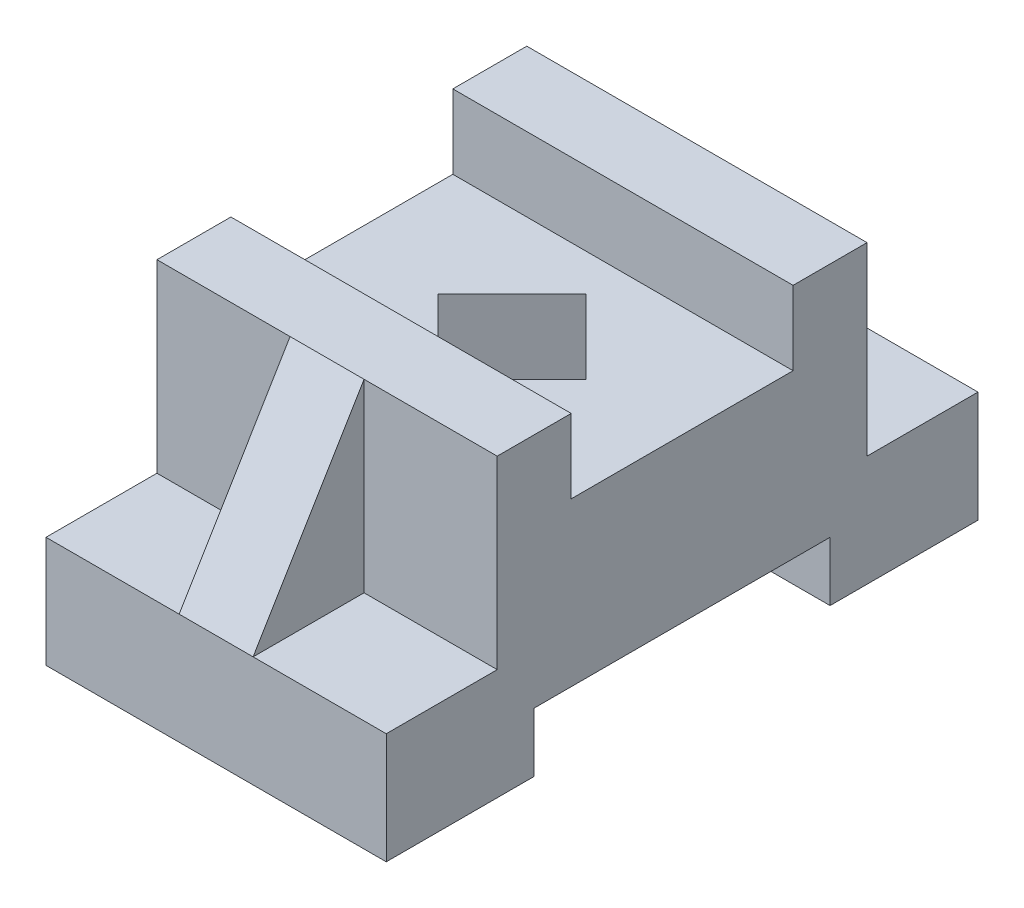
ISO-10303-21;
HEADER;
FILE_DESCRIPTION(('STEP AP214'),'2;1');
FILE_NAME('part.step','',(''),(''),'','','');
FILE_SCHEMA(('AUTOMOTIVE_DESIGN { 1 0 10303 214 1 1 1 1 }'));
ENDSEC;
DATA;
#1=APPLICATION_CONTEXT('core data for automotive mechanical design processes');
#2=APPLICATION_PROTOCOL_DEFINITION('international standard','automotive_design',2000,#1);
#3=PRODUCT_CONTEXT('',#1,'mechanical');
#4=PRODUCT('Part','Part','',(#3));
#5=PRODUCT_RELATED_PRODUCT_CATEGORY('part','',(#4));
#6=PRODUCT_DEFINITION_FORMATION('','',#4);
#7=PRODUCT_DEFINITION_CONTEXT('part definition',#1,'design');
#8=PRODUCT_DEFINITION('design','',#6,#7);
#9=PRODUCT_DEFINITION_SHAPE('','',#8);
#10=(LENGTH_UNIT() NAMED_UNIT(*) SI_UNIT(.MILLI.,.METRE.));
#11=(NAMED_UNIT(*) PLANE_ANGLE_UNIT() SI_UNIT($,.RADIAN.));
#12=(NAMED_UNIT(*) SI_UNIT($,.STERADIAN.) SOLID_ANGLE_UNIT());
#13=UNCERTAINTY_MEASURE_WITH_UNIT(LENGTH_MEASURE(1.E-05),#10,'distance_accuracy_value','');
#14=(GEOMETRIC_REPRESENTATION_CONTEXT(3) GLOBAL_UNCERTAINTY_ASSIGNED_CONTEXT((#13)) GLOBAL_UNIT_ASSIGNED_CONTEXT((#10,
#11,#12)) REPRESENTATION_CONTEXT('',''));
#15=CARTESIAN_POINT('',(0.,0.,0.));
#16=DIRECTION('',(0.,0.,1.));
#17=DIRECTION('',(1.,0.,0.));
#18=AXIS2_PLACEMENT_3D('',#15,#16,#17);
#19=CARTESIAN_POINT('',(23.,10.,0.));
#20=DIRECTION('',(1.,0.,0.));
#21=DIRECTION('',(0.,0.,-1.));
#22=AXIS2_PLACEMENT_3D('',#19,#20,#21);
#23=PLANE('',#22);
#24=DIRECTION('',(0.,0.,1.));
#25=VECTOR('',#24,1.);
#26=CARTESIAN_POINT('',(23.,-22.,0.));
#27=LINE('',#26,#25);
#28=CARTESIAN_POINT('',(23.,-22.,-20.));
#29=VERTEX_POINT('',#28);
#30=CARTESIAN_POINT('',(23.,-22.,20.));
#31=VERTEX_POINT('',#30);
#32=EDGE_CURVE('E226',#29,#31,#27,.T.);
#33=ORIENTED_EDGE('',*,*,#32,.F.);
#34=DIRECTION('',(0.,-1.,0.));
#35=VECTOR('',#34,1.);
#36=CARTESIAN_POINT('',(23.,-22.,-20.));
#37=LINE('',#36,#35);
#38=CARTESIAN_POINT('',(23.,-30.,-20.));
#39=VERTEX_POINT('',#38);
#40=EDGE_CURVE('E209',#29,#39,#37,.T.);
#41=ORIENTED_EDGE('',*,*,#40,.T.);
#42=DIRECTION('',(0.,0.,1.));
#43=VECTOR('',#42,1.);
#44=CARTESIAN_POINT('',(23.,-30.,0.));
#45=LINE('',#44,#43);
#46=CARTESIAN_POINT('',(23.,-30.,-40.));
#47=VERTEX_POINT('',#46);
#48=EDGE_CURVE('E379',#47,#39,#45,.T.);
#49=ORIENTED_EDGE('',*,*,#48,.F.);
#50=DIRECTION('',(0.,-1.,0.));
#51=VECTOR('',#50,1.);
#52=CARTESIAN_POINT('',(23.,10.,-40.));
#53=LINE('',#52,#51);
#54=CARTESIAN_POINT('',(23.,-15.,-40.));
#55=VERTEX_POINT('',#54);
#56=EDGE_CURVE('E39',#55,#47,#53,.T.);
#57=ORIENTED_EDGE('',*,*,#56,.F.);
#58=DIRECTION('',(0.,0.,-1.));
#59=VECTOR('',#58,1.);
#60=CARTESIAN_POINT('',(23.,-15.,0.));
#61=LINE('',#60,#59);
#62=CARTESIAN_POINT('',(23.,-15.,-25.));
#63=VERTEX_POINT('',#62);
#64=EDGE_CURVE('E293',#63,#55,#61,.T.);
#65=ORIENTED_EDGE('',*,*,#64,.F.);
#66=DIRECTION('',(0.,-1.,0.));
#67=VECTOR('',#66,1.);
#68=CARTESIAN_POINT('',(23.,10.,-25.));
#69=LINE('',#68,#67);
#70=CARTESIAN_POINT('',(23.,10.,-25.));
#71=VERTEX_POINT('',#70);
#72=EDGE_CURVE('E338',#71,#63,#69,.T.);
#73=ORIENTED_EDGE('',*,*,#72,.F.);
#74=DIRECTION('',(0.,0.,1.));
#75=VECTOR('',#74,1.);
#76=CARTESIAN_POINT('',(23.,10.,0.));
#77=LINE('',#76,#75);
#78=CARTESIAN_POINT('',(23.,10.,-15.));
#79=VERTEX_POINT('',#78);
#80=EDGE_CURVE('E394',#71,#79,#77,.T.);
#81=ORIENTED_EDGE('',*,*,#80,.T.);
#82=DIRECTION('',(0.,-1.,0.));
#83=VECTOR('',#82,1.);
#84=CARTESIAN_POINT('',(23.,10.,-15.));
#85=LINE('',#84,#83);
#86=CARTESIAN_POINT('',(23.,0.,-15.));
#87=VERTEX_POINT('',#86);
#88=EDGE_CURVE('E373',#79,#87,#85,.T.);
#89=ORIENTED_EDGE('',*,*,#88,.T.);
#90=DIRECTION('',(0.,0.,-1.));
#91=VECTOR('',#90,1.);
#92=CARTESIAN_POINT('',(23.,0.,0.));
#93=LINE('',#92,#91);
#94=CARTESIAN_POINT('',(23.,0.,15.0000000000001));
#95=VERTEX_POINT('',#94);
#96=EDGE_CURVE('E362',#95,#87,#93,.T.);
#97=ORIENTED_EDGE('',*,*,#96,.F.);
#98=DIRECTION('',(0.,-1.,0.));
#99=VECTOR('',#98,1.);
#100=CARTESIAN_POINT('',(23.,10.,15.0000000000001));
#101=LINE('',#100,#99);
#102=CARTESIAN_POINT('',(23.,10.,15.0000000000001));
#103=VERTEX_POINT('',#102);
#104=EDGE_CURVE('E376',#103,#95,#101,.T.);
#105=ORIENTED_EDGE('',*,*,#104,.F.);
#106=CARTESIAN_POINT('',(23.,10.,25.0000000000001));
#107=VERTEX_POINT('',#106);
#108=EDGE_CURVE('E391',#103,#107,#77,.T.);
#109=ORIENTED_EDGE('',*,*,#108,.T.);
#110=DIRECTION('',(0.,-1.,0.));
#111=VECTOR('',#110,1.);
#112=CARTESIAN_POINT('',(23.,10.,25.0000000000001));
#113=LINE('',#112,#111);
#114=CARTESIAN_POINT('',(23.,-15.,25.0000000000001));
#115=VERTEX_POINT('',#114);
#116=EDGE_CURVE('E319',#107,#115,#113,.T.);
#117=ORIENTED_EDGE('',*,*,#116,.T.);
#118=DIRECTION('',(0.,0.,1.));
#119=VECTOR('',#118,1.);
#120=CARTESIAN_POINT('',(23.,-15.,0.));
#121=LINE('',#120,#119);
#122=CARTESIAN_POINT('',(23.,-15.,40.0000000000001));
#123=VERTEX_POINT('',#122);
#124=EDGE_CURVE('E279',#115,#123,#121,.T.);
#125=ORIENTED_EDGE('',*,*,#124,.T.);
#126=DIRECTION('',(0.,-1.,0.));
#127=VECTOR('',#126,1.);
#128=CARTESIAN_POINT('',(23.,10.,40.0000000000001));
#129=LINE('',#128,#127);
#130=CARTESIAN_POINT('',(23.,-30.,40.0000000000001));
#131=VERTEX_POINT('',#130);
#132=EDGE_CURVE('E407',#123,#131,#129,.T.);
#133=ORIENTED_EDGE('',*,*,#132,.T.);
#134=CARTESIAN_POINT('',(23.,-30.,20.));
#135=VERTEX_POINT('',#134);
#136=EDGE_CURVE('E378',#135,#131,#45,.T.);
#137=ORIENTED_EDGE('',*,*,#136,.F.);
#138=DIRECTION('',(0.,-1.,0.));
#139=VECTOR('',#138,1.);
#140=CARTESIAN_POINT('',(23.,-22.,20.));
#141=LINE('',#140,#139);
#142=EDGE_CURVE('E60',#31,#135,#141,.T.);
#143=ORIENTED_EDGE('',*,*,#142,.F.);
#144=EDGE_LOOP('',(#33,#41,#49,#57,#65,#73,#81,#89,#97,#105,#109,#117,#125,#133,#137,#143));
#145=FACE_BOUND('',#144,.T.);
#146=ADVANCED_FACE('F36',(#145),#23,.T.);
#147=CARTESIAN_POINT('',(-23.,10.,0.));
#148=DIRECTION('',(1.,0.,0.));
#149=DIRECTION('',(0.,0.,-1.));
#150=AXIS2_PLACEMENT_3D('',#147,#148,#149);
#151=PLANE('',#150);
#152=DIRECTION('',(0.,-1.,0.));
#153=VECTOR('',#152,1.);
#154=CARTESIAN_POINT('',(-23.,-22.,-20.));
#155=LINE('',#154,#153);
#156=CARTESIAN_POINT('',(-23.,-22.,-20.));
#157=VERTEX_POINT('',#156);
#158=CARTESIAN_POINT('',(-23.,-30.,-20.));
#159=VERTEX_POINT('',#158);
#160=EDGE_CURVE('E246',#157,#159,#155,.T.);
#161=ORIENTED_EDGE('',*,*,#160,.F.);
#162=DIRECTION('',(0.,0.,-1.));
#163=VECTOR('',#162,1.);
#164=CARTESIAN_POINT('',(-23.,-22.,0.));
#165=LINE('',#164,#163);
#166=CARTESIAN_POINT('',(-23.,-22.,20.));
#167=VERTEX_POINT('',#166);
#168=EDGE_CURVE('E228',#167,#157,#165,.T.);
#169=ORIENTED_EDGE('',*,*,#168,.F.);
#170=DIRECTION('',(0.,-1.,0.));
#171=VECTOR('',#170,1.);
#172=CARTESIAN_POINT('',(-23.,-22.,20.));
#173=LINE('',#172,#171);
#174=CARTESIAN_POINT('',(-23.,-30.,20.));
#175=VERTEX_POINT('',#174);
#176=EDGE_CURVE('E249',#167,#175,#173,.T.);
#177=ORIENTED_EDGE('',*,*,#176,.T.);
#178=DIRECTION('',(0.,0.,1.));
#179=VECTOR('',#178,1.);
#180=CARTESIAN_POINT('',(-23.,-30.,0.));
#181=LINE('',#180,#179);
#182=CARTESIAN_POINT('',(-23.,-30.,40.0000000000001));
#183=VERTEX_POINT('',#182);
#184=EDGE_CURVE('E384',#175,#183,#181,.T.);
#185=ORIENTED_EDGE('',*,*,#184,.T.);
#186=DIRECTION('',(0.,-1.,0.));
#187=VECTOR('',#186,1.);
#188=CARTESIAN_POINT('',(-23.,10.,40.0000000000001));
#189=LINE('',#188,#187);
#190=CARTESIAN_POINT('',(-23.,-15.,40.0000000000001));
#191=VERTEX_POINT('',#190);
#192=EDGE_CURVE('E410',#191,#183,#189,.T.);
#193=ORIENTED_EDGE('',*,*,#192,.F.);
#194=DIRECTION('',(0.,0.,1.));
#195=VECTOR('',#194,1.);
#196=CARTESIAN_POINT('',(-23.,-15.,0.));
#197=LINE('',#196,#195);
#198=CARTESIAN_POINT('',(-23.,-15.,25.0000000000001));
#199=VERTEX_POINT('',#198);
#200=EDGE_CURVE('E313',#199,#191,#197,.T.);
#201=ORIENTED_EDGE('',*,*,#200,.F.);
#202=DIRECTION('',(0.,-1.,0.));
#203=VECTOR('',#202,1.);
#204=CARTESIAN_POINT('',(-23.,10.,25.0000000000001));
#205=LINE('',#204,#203);
#206=CARTESIAN_POINT('',(-23.,10.,25.0000000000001));
#207=VERTEX_POINT('',#206);
#208=EDGE_CURVE('E318',#207,#199,#205,.T.);
#209=ORIENTED_EDGE('',*,*,#208,.F.);
#210=DIRECTION('',(0.,0.,1.));
#211=VECTOR('',#210,1.);
#212=CARTESIAN_POINT('',(-23.,10.,0.));
#213=LINE('',#212,#211);
#214=CARTESIAN_POINT('',(-23.,10.,15.0000000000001));
#215=VERTEX_POINT('',#214);
#216=EDGE_CURVE('E395',#215,#207,#213,.T.);
#217=ORIENTED_EDGE('',*,*,#216,.F.);
#218=DIRECTION('',(0.,-1.,0.));
#219=VECTOR('',#218,1.);
#220=CARTESIAN_POINT('',(-23.,10.,15.0000000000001));
#221=LINE('',#220,#219);
#222=CARTESIAN_POINT('',(-23.,0.,15.0000000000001));
#223=VERTEX_POINT('',#222);
#224=EDGE_CURVE('E347',#215,#223,#221,.T.);
#225=ORIENTED_EDGE('',*,*,#224,.T.);
#226=DIRECTION('',(0.,0.,-1.));
#227=VECTOR('',#226,1.);
#228=CARTESIAN_POINT('',(-23.,0.,0.));
#229=LINE('',#228,#227);
#230=CARTESIAN_POINT('',(-23.,0.,-15.));
#231=VERTEX_POINT('',#230);
#232=EDGE_CURVE('E344',#223,#231,#229,.T.);
#233=ORIENTED_EDGE('',*,*,#232,.T.);
#234=DIRECTION('',(0.,-1.,0.));
#235=VECTOR('',#234,1.);
#236=CARTESIAN_POINT('',(-23.,10.,-15.));
#237=LINE('',#236,#235);
#238=CARTESIAN_POINT('',(-23.,10.,-15.));
#239=VERTEX_POINT('',#238);
#240=EDGE_CURVE('E371',#239,#231,#237,.T.);
#241=ORIENTED_EDGE('',*,*,#240,.F.);
#242=CARTESIAN_POINT('',(-23.,10.,-25.));
#243=VERTEX_POINT('',#242);
#244=EDGE_CURVE('E398',#243,#239,#213,.T.);
#245=ORIENTED_EDGE('',*,*,#244,.F.);
#246=DIRECTION('',(0.,-1.,0.));
#247=VECTOR('',#246,1.);
#248=CARTESIAN_POINT('',(-23.,10.,-25.));
#249=LINE('',#248,#247);
#250=CARTESIAN_POINT('',(-23.,-15.,-25.));
#251=VERTEX_POINT('',#250);
#252=EDGE_CURVE('E328',#243,#251,#249,.T.);
#253=ORIENTED_EDGE('',*,*,#252,.T.);
#254=DIRECTION('',(0.,0.,-1.));
#255=VECTOR('',#254,1.);
#256=CARTESIAN_POINT('',(-23.,-15.,0.));
#257=LINE('',#256,#255);
#258=CARTESIAN_POINT('',(-23.,-15.,-40.));
#259=VERTEX_POINT('',#258);
#260=EDGE_CURVE('E298',#251,#259,#257,.T.);
#261=ORIENTED_EDGE('',*,*,#260,.T.);
#262=DIRECTION('',(0.,-1.,0.));
#263=VECTOR('',#262,1.);
#264=CARTESIAN_POINT('',(-23.,10.,-40.));
#265=LINE('',#264,#263);
#266=CARTESIAN_POINT('',(-23.,-30.,-40.));
#267=VERTEX_POINT('',#266);
#268=EDGE_CURVE('E412',#259,#267,#265,.T.);
#269=ORIENTED_EDGE('',*,*,#268,.T.);
#270=EDGE_CURVE('E385',#267,#159,#181,.T.);
#271=ORIENTED_EDGE('',*,*,#270,.T.);
#272=EDGE_LOOP('',(#161,#169,#177,#185,#193,#201,#209,#217,#225,#233,#241,#245,#253,#261,#269,#271));
#273=FACE_BOUND('',#272,.T.);
#274=ADVANCED_FACE('F424',(#273),#151,.F.);
#275=CARTESIAN_POINT('',(4.99999999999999,10.,-4.99999999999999));
#276=DIRECTION('',(-0.707106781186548,0.,0.707106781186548));
#277=DIRECTION('',(0.707106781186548,0.,0.707106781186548));
#278=AXIS2_PLACEMENT_3D('',#275,#276,#277);
#279=PLANE('',#278);
#280=DIRECTION('',(0.,-1.,0.));
#281=VECTOR('',#280,1.);
#282=CARTESIAN_POINT('',(0.,10.,-9.99999999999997));
#283=LINE('',#282,#281);
#284=CARTESIAN_POINT('',(0.,0.,-9.99999999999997));
#285=VERTEX_POINT('',#284);
#286=CARTESIAN_POINT('',(0.,-22.,-9.99999999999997));
#287=VERTEX_POINT('',#286);
#288=EDGE_CURVE('E399',#285,#287,#283,.T.);
#289=ORIENTED_EDGE('',*,*,#288,.T.);
#290=DIRECTION('',(-0.707106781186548,0.,-0.707106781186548));
#291=VECTOR('',#290,1.);
#292=CARTESIAN_POINT('',(4.99999999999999,-22.,-4.99999999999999));
#293=LINE('',#292,#291);
#294=CARTESIAN_POINT('',(10.,-22.,0.));
#295=VERTEX_POINT('',#294);
#296=EDGE_CURVE('E52',#295,#287,#293,.T.);
#297=ORIENTED_EDGE('',*,*,#296,.F.);
#298=DIRECTION('',(0.,-1.,0.));
#299=VECTOR('',#298,1.);
#300=CARTESIAN_POINT('',(10.,10.,0.));
#301=LINE('',#300,#299);
#302=CARTESIAN_POINT('',(10.,0.,0.));
#303=VERTEX_POINT('',#302);
#304=EDGE_CURVE('E11',#303,#295,#301,.T.);
#305=ORIENTED_EDGE('',*,*,#304,.F.);
#306=DIRECTION('',(-0.707106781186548,0.,-0.707106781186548));
#307=VECTOR('',#306,1.);
#308=CARTESIAN_POINT('',(4.99999999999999,0.,-4.99999999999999));
#309=LINE('',#308,#307);
#310=EDGE_CURVE('E323',#303,#285,#309,.T.);
#311=ORIENTED_EDGE('',*,*,#310,.T.);
#312=EDGE_LOOP('',(#289,#297,#305,#311));
#313=FACE_BOUND('',#312,.T.);
#314=ADVANCED_FACE('F474',(#313),#279,.T.);
#315=CARTESIAN_POINT('',(5.00000000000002,10.,5.00000000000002));
#316=DIRECTION('',(-0.707106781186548,0.,-0.707106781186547));
#317=DIRECTION('',(-0.707106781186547,0.,0.707106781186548));
#318=AXIS2_PLACEMENT_3D('',#315,#316,#317);
#319=PLANE('',#318);
#320=ORIENTED_EDGE('',*,*,#304,.T.);
#321=DIRECTION('',(0.707106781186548,0.,-0.707106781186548));
#322=VECTOR('',#321,1.);
#323=CARTESIAN_POINT('',(5.00000000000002,-22.,5.00000000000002));
#324=LINE('',#323,#322);
#325=CARTESIAN_POINT('',(0.,-22.,10.));
#326=VERTEX_POINT('',#325);
#327=EDGE_CURVE('E238',#326,#295,#324,.T.);
#328=ORIENTED_EDGE('',*,*,#327,.F.);
#329=DIRECTION('',(0.,-1.,0.));
#330=VECTOR('',#329,1.);
#331=CARTESIAN_POINT('',(0.,10.,10.));
#332=LINE('',#331,#330);
#333=CARTESIAN_POINT('',(0.,0.,10.));
#334=VERTEX_POINT('',#333);
#335=EDGE_CURVE('E44',#334,#326,#332,.T.);
#336=ORIENTED_EDGE('',*,*,#335,.F.);
#337=DIRECTION('',(0.707106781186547,0.,-0.707106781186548));
#338=VECTOR('',#337,1.);
#339=CARTESIAN_POINT('',(5.00000000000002,0.,5.00000000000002));
#340=LINE('',#339,#338);
#341=EDGE_CURVE('E350',#334,#303,#340,.T.);
#342=ORIENTED_EDGE('',*,*,#341,.T.);
#343=EDGE_LOOP('',(#320,#328,#336,#342));
#344=FACE_BOUND('',#343,.T.);
#345=ADVANCED_FACE('F479',(#344),#319,.T.);
#346=CARTESIAN_POINT('',(-5.00000000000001,10.,5.00000000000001));
#347=DIRECTION('',(0.707106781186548,0.,-0.707106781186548));
#348=DIRECTION('',(-0.707106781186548,0.,-0.707106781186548));
#349=AXIS2_PLACEMENT_3D('',#346,#347,#348);
#350=PLANE('',#349);
#351=ORIENTED_EDGE('',*,*,#335,.T.);
#352=DIRECTION('',(0.707106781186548,0.,0.707106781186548));
#353=VECTOR('',#352,1.);
#354=CARTESIAN_POINT('',(-5.00000000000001,-22.,5.00000000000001));
#355=LINE('',#354,#353);
#356=CARTESIAN_POINT('',(-9.99999999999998,-22.,0.));
#357=VERTEX_POINT('',#356);
#358=EDGE_CURVE('E220',#357,#326,#355,.T.);
#359=ORIENTED_EDGE('',*,*,#358,.F.);
#360=DIRECTION('',(0.,-1.,0.));
#361=VECTOR('',#360,1.);
#362=CARTESIAN_POINT('',(-9.99999999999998,10.,0.));
#363=LINE('',#362,#361);
#364=CARTESIAN_POINT('',(-9.99999999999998,0.,0.));
#365=VERTEX_POINT('',#364);
#366=EDGE_CURVE('E402',#365,#357,#363,.T.);
#367=ORIENTED_EDGE('',*,*,#366,.F.);
#368=DIRECTION('',(0.707106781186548,0.,0.707106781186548));
#369=VECTOR('',#368,1.);
#370=CARTESIAN_POINT('',(-5.00000000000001,0.,5.00000000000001));
#371=LINE('',#370,#369);
#372=EDGE_CURVE('E353',#365,#334,#371,.T.);
#373=ORIENTED_EDGE('',*,*,#372,.T.);
#374=EDGE_LOOP('',(#351,#359,#367,#373));
#375=FACE_BOUND('',#374,.T.);
#376=ADVANCED_FACE('F494',(#375),#350,.T.);
#377=CARTESIAN_POINT('',(-4.99999999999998,10.,-4.99999999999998));
#378=DIRECTION('',(0.707106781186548,0.,0.707106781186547));
#379=DIRECTION('',(0.707106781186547,0.,-0.707106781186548));
#380=AXIS2_PLACEMENT_3D('',#377,#378,#379);
#381=PLANE('',#380);
#382=ORIENTED_EDGE('',*,*,#366,.T.);
#383=DIRECTION('',(-0.707106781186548,0.,0.707106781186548));
#384=VECTOR('',#383,1.);
#385=CARTESIAN_POINT('',(-4.99999999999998,-22.,-4.99999999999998));
#386=LINE('',#385,#384);
#387=EDGE_CURVE('E241',#287,#357,#386,.T.);
#388=ORIENTED_EDGE('',*,*,#387,.F.);
#389=ORIENTED_EDGE('',*,*,#288,.F.);
#390=DIRECTION('',(-0.707106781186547,0.,0.707106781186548));
#391=VECTOR('',#390,1.);
#392=CARTESIAN_POINT('',(-4.99999999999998,0.,-4.99999999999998));
#393=LINE('',#392,#391);
#394=EDGE_CURVE('E356',#285,#365,#393,.T.);
#395=ORIENTED_EDGE('',*,*,#394,.T.);
#396=EDGE_LOOP('',(#382,#388,#389,#395));
#397=FACE_BOUND('',#396,.T.);
#398=ADVANCED_FACE('F489',(#397),#381,.T.);
#399=CARTESIAN_POINT('',(0.,-30.,0.));
#400=DIRECTION('',(0.,1.,0.));
#401=DIRECTION('',(0.,0.,1.));
#402=AXIS2_PLACEMENT_3D('',#399,#400,#401);
#403=PLANE('',#402);
#404=DIRECTION('',(-1.,0.,0.));
#405=VECTOR('',#404,1.);
#406=CARTESIAN_POINT('',(0.,-30.,-20.));
#407=LINE('',#406,#405);
#408=EDGE_CURVE('E215',#39,#159,#407,.T.);
#409=ORIENTED_EDGE('',*,*,#408,.T.);
#410=ORIENTED_EDGE('',*,*,#270,.F.);
#411=DIRECTION('',(1.,0.,0.));
#412=VECTOR('',#411,1.);
#413=CARTESIAN_POINT('',(0.,-30.,-40.));
#414=LINE('',#413,#412);
#415=EDGE_CURVE('E381',#267,#47,#414,.T.);
#416=ORIENTED_EDGE('',*,*,#415,.T.);
#417=ORIENTED_EDGE('',*,*,#48,.T.);
#418=EDGE_LOOP('',(#409,#410,#416,#417));
#419=FACE_BOUND('',#418,.T.);
#420=ADVANCED_FACE('F423',(#419),#403,.F.);
#421=CARTESIAN_POINT('',(0.,10.,-40.));
#422=DIRECTION('',(0.,0.,-1.));
#423=DIRECTION('',(-1.,0.,0.));
#424=AXIS2_PLACEMENT_3D('',#421,#422,#423);
#425=PLANE('',#424);
#426=DIRECTION('',(1.,0.,0.));
#427=VECTOR('',#426,1.);
#428=CARTESIAN_POINT('',(-9.99999999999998,-15.,-40.));
#429=LINE('',#428,#427);
#430=CARTESIAN_POINT('',(-4.99999999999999,-15.,-40.));
#431=VERTEX_POINT('',#430);
#432=CARTESIAN_POINT('',(5.00000000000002,-15.,-40.));
#433=VERTEX_POINT('',#432);
#434=EDGE_CURVE('E255',#431,#433,#429,.T.);
#435=ORIENTED_EDGE('',*,*,#434,.T.);
#436=DIRECTION('',(1.,0.,0.));
#437=VECTOR('',#436,1.);
#438=CARTESIAN_POINT('',(0.,-15.,-40.));
#439=LINE('',#438,#437);
#440=EDGE_CURVE('E277',#433,#55,#439,.T.);
#441=ORIENTED_EDGE('',*,*,#440,.T.);
#442=ORIENTED_EDGE('',*,*,#56,.T.);
#443=ORIENTED_EDGE('',*,*,#415,.F.);
#444=ORIENTED_EDGE('',*,*,#268,.F.);
#445=DIRECTION('',(1.,0.,0.));
#446=VECTOR('',#445,1.);
#447=CARTESIAN_POINT('',(0.,-15.,-40.));
#448=LINE('',#447,#446);
#449=EDGE_CURVE('E272',#259,#431,#448,.T.);
#450=ORIENTED_EDGE('',*,*,#449,.T.);
#451=EDGE_LOOP('',(#435,#441,#442,#443,#444,#450));
#452=FACE_BOUND('',#451,.T.);
#453=ADVANCED_FACE('F418',(#452),#425,.T.);
#454=CARTESIAN_POINT('',(0.,10.,40.0000000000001));
#455=DIRECTION('',(0.,0.,-1.));
#456=DIRECTION('',(-1.,0.,0.));
#457=AXIS2_PLACEMENT_3D('',#454,#455,#456);
#458=PLANE('',#457);
#459=DIRECTION('',(1.,0.,0.));
#460=VECTOR('',#459,1.);
#461=CARTESIAN_POINT('',(0.,-15.,40.0000000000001));
#462=LINE('',#461,#460);
#463=CARTESIAN_POINT('',(5.00000000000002,-15.,40.0000000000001));
#464=VERTEX_POINT('',#463);
#465=EDGE_CURVE('E276',#464,#123,#462,.T.);
#466=ORIENTED_EDGE('',*,*,#465,.F.);
#467=DIRECTION('',(1.,0.,0.));
#468=VECTOR('',#467,1.);
#469=CARTESIAN_POINT('',(-9.99999999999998,-15.,40.0000000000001));
#470=LINE('',#469,#468);
#471=CARTESIAN_POINT('',(-4.99999999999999,-15.,40.0000000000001));
#472=VERTEX_POINT('',#471);
#473=EDGE_CURVE('E263',#472,#464,#470,.T.);
#474=ORIENTED_EDGE('',*,*,#473,.F.);
#475=DIRECTION('',(1.,0.,0.));
#476=VECTOR('',#475,1.);
#477=CARTESIAN_POINT('',(0.,-15.,40.0000000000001));
#478=LINE('',#477,#476);
#479=EDGE_CURVE('E285',#191,#472,#478,.T.);
#480=ORIENTED_EDGE('',*,*,#479,.F.);
#481=ORIENTED_EDGE('',*,*,#192,.T.);
#482=DIRECTION('',(1.,0.,0.));
#483=VECTOR('',#482,1.);
#484=CARTESIAN_POINT('',(0.,-30.,40.0000000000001));
#485=LINE('',#484,#483);
#486=EDGE_CURVE('E388',#183,#131,#485,.T.);
#487=ORIENTED_EDGE('',*,*,#486,.T.);
#488=ORIENTED_EDGE('',*,*,#132,.F.);
#489=EDGE_LOOP('',(#466,#474,#480,#481,#487,#488));
#490=FACE_BOUND('',#489,.T.);
#491=ADVANCED_FACE('F433',(#490),#458,.F.);
#492=CARTESIAN_POINT('',(0.,10.,0.));
#493=DIRECTION('',(0.,1.,0.));
#494=DIRECTION('',(0.,0.,1.));
#495=AXIS2_PLACEMENT_3D('',#492,#493,#494);
#496=PLANE('',#495);
#497=DIRECTION('',(1.,0.,0.));
#498=VECTOR('',#497,1.);
#499=CARTESIAN_POINT('',(-9.99999999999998,10.,-25.));
#500=LINE('',#499,#498);
#501=CARTESIAN_POINT('',(-4.99999999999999,10.,-25.));
#502=VERTEX_POINT('',#501);
#503=CARTESIAN_POINT('',(5.00000000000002,10.,-25.));
#504=VERTEX_POINT('',#503);
#505=EDGE_CURVE('E257',#502,#504,#500,.T.);
#506=ORIENTED_EDGE('',*,*,#505,.F.);
#507=DIRECTION('',(1.,0.,0.));
#508=VECTOR('',#507,1.);
#509=CARTESIAN_POINT('',(0.,10.,-25.));
#510=LINE('',#509,#508);
#511=EDGE_CURVE('E331',#243,#502,#510,.T.);
#512=ORIENTED_EDGE('',*,*,#511,.F.);
#513=ORIENTED_EDGE('',*,*,#244,.T.);
#514=DIRECTION('',(1.,0.,0.));
#515=VECTOR('',#514,1.);
#516=CARTESIAN_POINT('',(0.,10.,-15.));
#517=LINE('',#516,#515);
#518=EDGE_CURVE('E343',#239,#79,#517,.T.);
#519=ORIENTED_EDGE('',*,*,#518,.T.);
#520=ORIENTED_EDGE('',*,*,#80,.F.);
#521=DIRECTION('',(1.,0.,0.));
#522=VECTOR('',#521,1.);
#523=CARTESIAN_POINT('',(0.,10.,-25.));
#524=LINE('',#523,#522);
#525=EDGE_CURVE('E315',#504,#71,#524,.T.);
#526=ORIENTED_EDGE('',*,*,#525,.F.);
#527=EDGE_LOOP('',(#506,#512,#513,#519,#520,#526));
#528=FACE_BOUND('',#527,.T.);
#529=ADVANCED_FACE('F488',(#528),#496,.T.);
#530=DIRECTION('',(1.,0.,0.));
#531=VECTOR('',#530,1.);
#532=CARTESIAN_POINT('',(-9.99999999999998,10.,25.0000000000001));
#533=LINE('',#532,#531);
#534=CARTESIAN_POINT('',(-4.99999999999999,10.,25.0000000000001));
#535=VERTEX_POINT('',#534);
#536=CARTESIAN_POINT('',(5.00000000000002,10.,25.0000000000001));
#537=VERTEX_POINT('',#536);
#538=EDGE_CURVE('E256',#535,#537,#533,.T.);
#539=ORIENTED_EDGE('',*,*,#538,.T.);
#540=DIRECTION('',(1.,0.,0.));
#541=VECTOR('',#540,1.);
#542=CARTESIAN_POINT('',(0.,10.,25.0000000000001));
#543=LINE('',#542,#541);
#544=EDGE_CURVE('E324',#537,#107,#543,.T.);
#545=ORIENTED_EDGE('',*,*,#544,.T.);
#546=ORIENTED_EDGE('',*,*,#108,.F.);
#547=DIRECTION('',(1.,0.,0.));
#548=VECTOR('',#547,1.);
#549=CARTESIAN_POINT('',(0.,10.,15.0000000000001));
#550=LINE('',#549,#548);
#551=EDGE_CURVE('E341',#215,#103,#550,.T.);
#552=ORIENTED_EDGE('',*,*,#551,.F.);
#553=ORIENTED_EDGE('',*,*,#216,.T.);
#554=DIRECTION('',(1.,0.,0.));
#555=VECTOR('',#554,1.);
#556=CARTESIAN_POINT('',(0.,10.,25.0000000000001));
#557=LINE('',#556,#555);
#558=EDGE_CURVE('E316',#207,#535,#557,.T.);
#559=ORIENTED_EDGE('',*,*,#558,.T.);
#560=EDGE_LOOP('',(#539,#545,#546,#552,#553,#559));
#561=FACE_BOUND('',#560,.T.);
#562=ADVANCED_FACE('F448',(#561),#496,.T.);
#563=ORIENTED_EDGE('',*,*,#184,.F.);
#564=DIRECTION('',(-1.,0.,0.));
#565=VECTOR('',#564,1.);
#566=CARTESIAN_POINT('',(0.,-30.,20.));
#567=LINE('',#566,#565);
#568=EDGE_CURVE('E230',#135,#175,#567,.T.);
#569=ORIENTED_EDGE('',*,*,#568,.F.);
#570=ORIENTED_EDGE('',*,*,#136,.T.);
#571=ORIENTED_EDGE('',*,*,#486,.F.);
#572=EDGE_LOOP('',(#563,#569,#570,#571));
#573=FACE_BOUND('',#572,.T.);
#574=ADVANCED_FACE('F429',(#573),#403,.F.);
#575=CARTESIAN_POINT('',(0.,10.,15.0000000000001));
#576=DIRECTION('',(0.,0.,-1.));
#577=DIRECTION('',(-1.,0.,0.));
#578=AXIS2_PLACEMENT_3D('',#575,#576,#577);
#579=PLANE('',#578);
#580=DIRECTION('',(1.,0.,0.));
#581=VECTOR('',#580,1.);
#582=CARTESIAN_POINT('',(0.,0.,15.0000000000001));
#583=LINE('',#582,#581);
#584=EDGE_CURVE('E359',#223,#95,#583,.T.);
#585=ORIENTED_EDGE('',*,*,#584,.F.);
#586=ORIENTED_EDGE('',*,*,#224,.F.);
#587=ORIENTED_EDGE('',*,*,#551,.T.);
#588=ORIENTED_EDGE('',*,*,#104,.T.);
#589=EDGE_LOOP('',(#585,#586,#587,#588));
#590=FACE_BOUND('',#589,.T.);
#591=ADVANCED_FACE('F500',(#590),#579,.T.);
#592=CARTESIAN_POINT('',(0.,10.,-15.));
#593=DIRECTION('',(0.,0.,-1.));
#594=DIRECTION('',(-1.,0.,0.));
#595=AXIS2_PLACEMENT_3D('',#592,#593,#594);
#596=PLANE('',#595);
#597=DIRECTION('',(1.,0.,0.));
#598=VECTOR('',#597,1.);
#599=CARTESIAN_POINT('',(0.,0.,-15.));
#600=LINE('',#599,#598);
#601=EDGE_CURVE('E364',#231,#87,#600,.T.);
#602=ORIENTED_EDGE('',*,*,#601,.T.);
#603=ORIENTED_EDGE('',*,*,#88,.F.);
#604=ORIENTED_EDGE('',*,*,#518,.F.);
#605=ORIENTED_EDGE('',*,*,#240,.T.);
#606=EDGE_LOOP('',(#602,#603,#604,#605));
#607=FACE_BOUND('',#606,.T.);
#608=ADVANCED_FACE('F466',(#607),#596,.F.);
#609=CARTESIAN_POINT('',(0.,0.,0.));
#610=DIRECTION('',(0.,1.,0.));
#611=DIRECTION('',(0.,0.,1.));
#612=AXIS2_PLACEMENT_3D('',#609,#610,#611);
#613=PLANE('',#612);
#614=ORIENTED_EDGE('',*,*,#310,.F.);
#615=ORIENTED_EDGE('',*,*,#341,.F.);
#616=ORIENTED_EDGE('',*,*,#372,.F.);
#617=ORIENTED_EDGE('',*,*,#394,.F.);
#618=EDGE_LOOP('',(#614,#615,#616,#617));
#619=FACE_BOUND('',#618,.T.);
#620=ORIENTED_EDGE('',*,*,#584,.T.);
#621=ORIENTED_EDGE('',*,*,#96,.T.);
#622=ORIENTED_EDGE('',*,*,#601,.F.);
#623=ORIENTED_EDGE('',*,*,#232,.F.);
#624=EDGE_LOOP('',(#620,#621,#622,#623));
#625=FACE_BOUND('',#624,.T.);
#626=ADVANCED_FACE('F458',(#619,#625),#613,.T.);
#627=CARTESIAN_POINT('',(-4.99999999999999,10.,0.));
#628=DIRECTION('',(-1.,0.,0.));
#629=DIRECTION('',(0.,0.,1.));
#630=AXIS2_PLACEMENT_3D('',#627,#628,#629);
#631=PLANE('',#630);
#632=DIRECTION('',(0.,-0.857492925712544,0.514495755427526));
#633=VECTOR('',#632,1.);
#634=CARTESIAN_POINT('',(-4.99999999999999,21.0294117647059,18.3823529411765));
#635=LINE('',#634,#633);
#636=EDGE_CURVE('E259',#535,#472,#635,.T.);
#637=ORIENTED_EDGE('',*,*,#636,.F.);
#638=DIRECTION('',(0.,-1.,0.));
#639=VECTOR('',#638,1.);
#640=CARTESIAN_POINT('',(-4.99999999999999,10.,25.0000000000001));
#641=LINE('',#640,#639);
#642=CARTESIAN_POINT('',(-4.99999999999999,-15.,25.0000000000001));
#643=VERTEX_POINT('',#642);
#644=EDGE_CURVE('E321',#535,#643,#641,.T.);
#645=ORIENTED_EDGE('',*,*,#644,.T.);
#646=DIRECTION('',(0.,0.,-1.));
#647=VECTOR('',#646,1.);
#648=CARTESIAN_POINT('',(-4.99999999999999,-15.,0.));
#649=LINE('',#648,#647);
#650=EDGE_CURVE('E307',#472,#643,#649,.T.);
#651=ORIENTED_EDGE('',*,*,#650,.F.);
#652=EDGE_LOOP('',(#637,#645,#651));
#653=FACE_BOUND('',#652,.T.);
#654=ADVANCED_FACE('F456',(#653),#631,.T.);
#655=CARTESIAN_POINT('',(0.,10.,25.0000000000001));
#656=DIRECTION('',(0.,0.,-1.));
#657=DIRECTION('',(-1.,0.,0.));
#658=AXIS2_PLACEMENT_3D('',#655,#656,#657);
#659=PLANE('',#658);
#660=ORIENTED_EDGE('',*,*,#208,.T.);
#661=DIRECTION('',(1.,0.,0.));
#662=VECTOR('',#661,1.);
#663=CARTESIAN_POINT('',(0.,-15.,25.0000000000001));
#664=LINE('',#663,#662);
#665=EDGE_CURVE('E310',#199,#643,#664,.T.);
#666=ORIENTED_EDGE('',*,*,#665,.T.);
#667=ORIENTED_EDGE('',*,*,#644,.F.);
#668=ORIENTED_EDGE('',*,*,#558,.F.);
#669=EDGE_LOOP('',(#660,#666,#667,#668));
#670=FACE_BOUND('',#669,.T.);
#671=ADVANCED_FACE('F445',(#670),#659,.F.);
#672=CARTESIAN_POINT('',(5.00000000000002,10.,0.));
#673=DIRECTION('',(-1.,0.,0.));
#674=DIRECTION('',(0.,0.,1.));
#675=AXIS2_PLACEMENT_3D('',#672,#673,#674);
#676=PLANE('',#675);
#677=DIRECTION('',(0.,-1.,0.));
#678=VECTOR('',#677,1.);
#679=CARTESIAN_POINT('',(5.00000000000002,10.,25.0000000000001));
#680=LINE('',#679,#678);
#681=CARTESIAN_POINT('',(5.00000000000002,-15.,25.0000000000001));
#682=VERTEX_POINT('',#681);
#683=EDGE_CURVE('E327',#537,#682,#680,.T.);
#684=ORIENTED_EDGE('',*,*,#683,.F.);
#685=DIRECTION('',(0.,0.857492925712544,-0.514495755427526));
#686=VECTOR('',#685,1.);
#687=CARTESIAN_POINT('',(5.00000000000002,-15.,40.0000000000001));
#688=LINE('',#687,#686);
#689=EDGE_CURVE('E248',#464,#537,#688,.T.);
#690=ORIENTED_EDGE('',*,*,#689,.F.);
#691=DIRECTION('',(0.,0.,-1.));
#692=VECTOR('',#691,1.);
#693=CARTESIAN_POINT('',(5.00000000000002,-15.,0.));
#694=LINE('',#693,#692);
#695=EDGE_CURVE('E273',#464,#682,#694,.T.);
#696=ORIENTED_EDGE('',*,*,#695,.T.);
#697=EDGE_LOOP('',(#684,#690,#696));
#698=FACE_BOUND('',#697,.T.);
#699=ADVANCED_FACE('F464',(#698),#676,.F.);
#700=CARTESIAN_POINT('',(0.,10.,25.0000000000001));
#701=DIRECTION('',(0.,0.,-1.));
#702=DIRECTION('',(-1.,0.,0.));
#703=AXIS2_PLACEMENT_3D('',#700,#701,#702);
#704=PLANE('',#703);
#705=ORIENTED_EDGE('',*,*,#683,.T.);
#706=DIRECTION('',(1.,0.,0.));
#707=VECTOR('',#706,1.);
#708=CARTESIAN_POINT('',(0.,-15.,25.0000000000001));
#709=LINE('',#708,#707);
#710=EDGE_CURVE('E282',#682,#115,#709,.T.);
#711=ORIENTED_EDGE('',*,*,#710,.T.);
#712=ORIENTED_EDGE('',*,*,#116,.F.);
#713=ORIENTED_EDGE('',*,*,#544,.F.);
#714=EDGE_LOOP('',(#705,#711,#712,#713));
#715=FACE_BOUND('',#714,.T.);
#716=ADVANCED_FACE('F545',(#715),#704,.F.);
#717=CARTESIAN_POINT('',(0.,10.,-25.));
#718=DIRECTION('',(0.,0.,-1.));
#719=DIRECTION('',(-1.,0.,0.));
#720=AXIS2_PLACEMENT_3D('',#717,#718,#719);
#721=PLANE('',#720);
#722=DIRECTION('',(0.,-1.,0.));
#723=VECTOR('',#722,1.);
#724=CARTESIAN_POINT('',(-4.99999999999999,10.,-25.));
#725=LINE('',#724,#723);
#726=CARTESIAN_POINT('',(-4.99999999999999,-15.,-25.));
#727=VERTEX_POINT('',#726);
#728=EDGE_CURVE('E333',#502,#727,#725,.T.);
#729=ORIENTED_EDGE('',*,*,#728,.T.);
#730=DIRECTION('',(1.,0.,0.));
#731=VECTOR('',#730,1.);
#732=CARTESIAN_POINT('',(0.,-15.,-25.));
#733=LINE('',#732,#731);
#734=EDGE_CURVE('E301',#251,#727,#733,.T.);
#735=ORIENTED_EDGE('',*,*,#734,.F.);
#736=ORIENTED_EDGE('',*,*,#252,.F.);
#737=ORIENTED_EDGE('',*,*,#511,.T.);
#738=EDGE_LOOP('',(#729,#735,#736,#737));
#739=FACE_BOUND('',#738,.T.);
#740=ADVANCED_FACE('F555',(#739),#721,.T.);
#741=CARTESIAN_POINT('',(-4.99999999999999,10.,0.));
#742=DIRECTION('',(-1.,0.,0.));
#743=DIRECTION('',(0.,0.,1.));
#744=AXIS2_PLACEMENT_3D('',#741,#742,#743);
#745=PLANE('',#744);
#746=DIRECTION('',(0.,0.857492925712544,0.514495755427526));
#747=VECTOR('',#746,1.);
#748=CARTESIAN_POINT('',(-4.99999999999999,21.0294117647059,-18.3823529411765));
#749=LINE('',#748,#747);
#750=EDGE_CURVE('E269',#431,#502,#749,.T.);
#751=ORIENTED_EDGE('',*,*,#750,.F.);
#752=DIRECTION('',(0.,0.,-1.));
#753=VECTOR('',#752,1.);
#754=CARTESIAN_POINT('',(-4.99999999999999,-15.,0.));
#755=LINE('',#754,#753);
#756=EDGE_CURVE('E290',#727,#431,#755,.T.);
#757=ORIENTED_EDGE('',*,*,#756,.F.);
#758=ORIENTED_EDGE('',*,*,#728,.F.);
#759=EDGE_LOOP('',(#751,#757,#758));
#760=FACE_BOUND('',#759,.T.);
#761=ADVANCED_FACE('F557',(#760),#745,.T.);
#762=CARTESIAN_POINT('',(5.00000000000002,10.,0.));
#763=DIRECTION('',(-1.,0.,0.));
#764=DIRECTION('',(0.,0.,1.));
#765=AXIS2_PLACEMENT_3D('',#762,#763,#764);
#766=PLANE('',#765);
#767=DIRECTION('',(0.,0.,-1.));
#768=VECTOR('',#767,1.);
#769=CARTESIAN_POINT('',(5.00000000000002,-15.,0.));
#770=LINE('',#769,#768);
#771=CARTESIAN_POINT('',(5.00000000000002,-15.,-25.));
#772=VERTEX_POINT('',#771);
#773=EDGE_CURVE('E286',#772,#433,#770,.T.);
#774=ORIENTED_EDGE('',*,*,#773,.T.);
#775=DIRECTION('',(0.,-0.857492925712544,-0.514495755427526));
#776=VECTOR('',#775,1.);
#777=CARTESIAN_POINT('',(5.00000000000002,-15.,-40.));
#778=LINE('',#777,#776);
#779=EDGE_CURVE('E253',#504,#433,#778,.T.);
#780=ORIENTED_EDGE('',*,*,#779,.F.);
#781=DIRECTION('',(0.,-1.,0.));
#782=VECTOR('',#781,1.);
#783=CARTESIAN_POINT('',(5.00000000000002,10.,-25.));
#784=LINE('',#783,#782);
#785=EDGE_CURVE('E334',#504,#772,#784,.T.);
#786=ORIENTED_EDGE('',*,*,#785,.T.);
#787=EDGE_LOOP('',(#774,#780,#786));
#788=FACE_BOUND('',#787,.T.);
#789=ADVANCED_FACE('F560',(#788),#766,.F.);
#790=CARTESIAN_POINT('',(0.,10.,-25.));
#791=DIRECTION('',(0.,0.,-1.));
#792=DIRECTION('',(-1.,0.,0.));
#793=AXIS2_PLACEMENT_3D('',#790,#791,#792);
#794=PLANE('',#793);
#795=ORIENTED_EDGE('',*,*,#72,.T.);
#796=DIRECTION('',(1.,0.,0.));
#797=VECTOR('',#796,1.);
#798=CARTESIAN_POINT('',(0.,-15.,-25.));
#799=LINE('',#798,#797);
#800=EDGE_CURVE('E289',#772,#63,#799,.T.);
#801=ORIENTED_EDGE('',*,*,#800,.F.);
#802=ORIENTED_EDGE('',*,*,#785,.F.);
#803=ORIENTED_EDGE('',*,*,#525,.T.);
#804=EDGE_LOOP('',(#795,#801,#802,#803));
#805=FACE_BOUND('',#804,.T.);
#806=ADVANCED_FACE('F565',(#805),#794,.T.);
#807=CARTESIAN_POINT('',(0.,-15.,0.));
#808=DIRECTION('',(0.,1.,0.));
#809=DIRECTION('',(0.,0.,1.));
#810=AXIS2_PLACEMENT_3D('',#807,#808,#809);
#811=PLANE('',#810);
#812=ORIENTED_EDGE('',*,*,#773,.F.);
#813=ORIENTED_EDGE('',*,*,#800,.T.);
#814=ORIENTED_EDGE('',*,*,#64,.T.);
#815=ORIENTED_EDGE('',*,*,#440,.F.);
#816=EDGE_LOOP('',(#812,#813,#814,#815));
#817=FACE_BOUND('',#816,.T.);
#818=ADVANCED_FACE('F568',(#817),#811,.T.);
#819=CARTESIAN_POINT('',(0.,-15.,0.));
#820=DIRECTION('',(0.,1.,0.));
#821=DIRECTION('',(0.,0.,1.));
#822=AXIS2_PLACEMENT_3D('',#819,#820,#821);
#823=PLANE('',#822);
#824=ORIENTED_EDGE('',*,*,#449,.F.);
#825=ORIENTED_EDGE('',*,*,#260,.F.);
#826=ORIENTED_EDGE('',*,*,#734,.T.);
#827=ORIENTED_EDGE('',*,*,#756,.T.);
#828=EDGE_LOOP('',(#824,#825,#826,#827));
#829=FACE_BOUND('',#828,.T.);
#830=ADVANCED_FACE('F667',(#829),#823,.T.);
#831=CARTESIAN_POINT('',(0.,-15.,0.));
#832=DIRECTION('',(0.,1.,0.));
#833=DIRECTION('',(0.,0.,1.));
#834=AXIS2_PLACEMENT_3D('',#831,#832,#833);
#835=PLANE('',#834);
#836=ORIENTED_EDGE('',*,*,#695,.F.);
#837=ORIENTED_EDGE('',*,*,#465,.T.);
#838=ORIENTED_EDGE('',*,*,#124,.F.);
#839=ORIENTED_EDGE('',*,*,#710,.F.);
#840=EDGE_LOOP('',(#836,#837,#838,#839));
#841=FACE_BOUND('',#840,.T.);
#842=ADVANCED_FACE('F548',(#841),#835,.T.);
#843=CARTESIAN_POINT('',(0.,-15.,0.));
#844=DIRECTION('',(0.,1.,0.));
#845=DIRECTION('',(0.,0.,1.));
#846=AXIS2_PLACEMENT_3D('',#843,#844,#845);
#847=PLANE('',#846);
#848=ORIENTED_EDGE('',*,*,#479,.T.);
#849=ORIENTED_EDGE('',*,*,#650,.T.);
#850=ORIENTED_EDGE('',*,*,#665,.F.);
#851=ORIENTED_EDGE('',*,*,#200,.T.);
#852=EDGE_LOOP('',(#848,#849,#850,#851));
#853=FACE_BOUND('',#852,.T.);
#854=ADVANCED_FACE('F441',(#853),#847,.T.);
#855=CARTESIAN_POINT('',(-9.99999999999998,-15.,-40.));
#856=DIRECTION('',(0.,-0.514495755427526,0.857492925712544));
#857=DIRECTION('',(0.,-0.857492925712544,-0.514495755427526));
#858=AXIS2_PLACEMENT_3D('',#855,#856,#857);
#859=PLANE('',#858);
#860=ORIENTED_EDGE('',*,*,#750,.T.);
#861=ORIENTED_EDGE('',*,*,#505,.T.);
#862=ORIENTED_EDGE('',*,*,#779,.T.);
#863=ORIENTED_EDGE('',*,*,#434,.F.);
#864=EDGE_LOOP('',(#860,#861,#862,#863));
#865=FACE_BOUND('',#864,.T.);
#866=ADVANCED_FACE('F694',(#865),#859,.F.);
#867=CARTESIAN_POINT('',(-9.99999999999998,-15.,40.0000000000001));
#868=DIRECTION('',(0.,-0.514495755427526,-0.857492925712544));
#869=DIRECTION('',(0.,0.857492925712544,-0.514495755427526));
#870=AXIS2_PLACEMENT_3D('',#867,#868,#869);
#871=PLANE('',#870);
#872=ORIENTED_EDGE('',*,*,#636,.T.);
#873=ORIENTED_EDGE('',*,*,#473,.T.);
#874=ORIENTED_EDGE('',*,*,#689,.T.);
#875=ORIENTED_EDGE('',*,*,#538,.F.);
#876=EDGE_LOOP('',(#872,#873,#874,#875));
#877=FACE_BOUND('',#876,.T.);
#878=ADVANCED_FACE('F453',(#877),#871,.F.);
#879=CARTESIAN_POINT('',(0.,-22.,-20.));
#880=DIRECTION('',(0.,0.,1.));
#881=DIRECTION('',(1.,0.,0.));
#882=AXIS2_PLACEMENT_3D('',#879,#880,#881);
#883=PLANE('',#882);
#884=ORIENTED_EDGE('',*,*,#408,.F.);
#885=ORIENTED_EDGE('',*,*,#40,.F.);
#886=DIRECTION('',(-1.,0.,0.));
#887=VECTOR('',#886,1.);
#888=CARTESIAN_POINT('',(0.,-22.,-20.));
#889=LINE('',#888,#887);
#890=EDGE_CURVE('E212',#29,#157,#889,.T.);
#891=ORIENTED_EDGE('',*,*,#890,.T.);
#892=ORIENTED_EDGE('',*,*,#160,.T.);
#893=EDGE_LOOP('',(#884,#885,#891,#892));
#894=FACE_BOUND('',#893,.T.);
#895=ADVANCED_FACE('F211',(#894),#883,.T.);
#896=CARTESIAN_POINT('',(0.,-22.,20.));
#897=DIRECTION('',(0.,0.,1.));
#898=DIRECTION('',(1.,0.,0.));
#899=AXIS2_PLACEMENT_3D('',#896,#897,#898);
#900=PLANE('',#899);
#901=ORIENTED_EDGE('',*,*,#568,.T.);
#902=ORIENTED_EDGE('',*,*,#176,.F.);
#903=DIRECTION('',(-1.,0.,0.));
#904=VECTOR('',#903,1.);
#905=CARTESIAN_POINT('',(0.,-22.,20.));
#906=LINE('',#905,#904);
#907=EDGE_CURVE('E233',#31,#167,#906,.T.);
#908=ORIENTED_EDGE('',*,*,#907,.F.);
#909=ORIENTED_EDGE('',*,*,#142,.T.);
#910=EDGE_LOOP('',(#901,#902,#908,#909));
#911=FACE_BOUND('',#910,.T.);
#912=ADVANCED_FACE('F766',(#911),#900,.F.);
#913=CARTESIAN_POINT('',(0.,-22.,0.));
#914=DIRECTION('',(0.,-1.,0.));
#915=DIRECTION('',(0.,0.,-1.));
#916=AXIS2_PLACEMENT_3D('',#913,#914,#915);
#917=PLANE('',#916);
#918=ORIENTED_EDGE('',*,*,#890,.F.);
#919=ORIENTED_EDGE('',*,*,#32,.T.);
#920=ORIENTED_EDGE('',*,*,#907,.T.);
#921=ORIENTED_EDGE('',*,*,#168,.T.);
#922=EDGE_LOOP('',(#918,#919,#920,#921));
#923=FACE_BOUND('',#922,.T.);
#924=ORIENTED_EDGE('',*,*,#327,.T.);
#925=ORIENTED_EDGE('',*,*,#296,.T.);
#926=ORIENTED_EDGE('',*,*,#387,.T.);
#927=ORIENTED_EDGE('',*,*,#358,.T.);
#928=EDGE_LOOP('',(#924,#925,#926,#927));
#929=FACE_BOUND('',#928,.T.);
#930=ADVANCED_FACE('F224',(#923,#929),#917,.T.);
#931=CLOSED_SHELL('',(#146,#274,#314,#345,#376,#398,#420,#453,#491,#529,#562,#574,#591,#608,
#626,#654,#671,#699,#716,#740,#761,#789,#806,#818,#830,#842,#854,#866,#878,#895,#912,#930));
#932=MANIFOLD_SOLID_BREP('B2',#931);
#933=ADVANCED_BREP_SHAPE_REPRESENTATION('',(#18,#932),#14);
#934=SHAPE_DEFINITION_REPRESENTATION(#9,#933);
ENDSEC;
END-ISO-10303-21;
